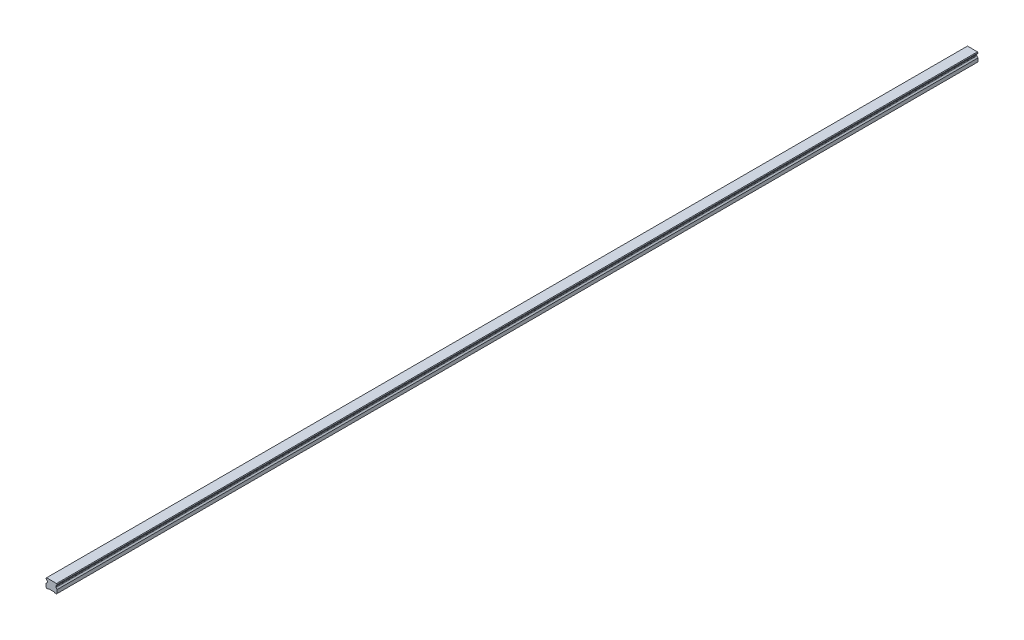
from build123d import *

# Parameters (mm, degrees)
SKETCH1_W           = 20
SKETCH1_H           = 16.3
BOSS_EXTRUDE1_DEPTH = 830
CUT_EXTRUDE1_DEPTH  = 1661.110143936
CHAMFER1_SIZE       = 1
FILLET1_R           = 1
CUT_EXTRUDE2_DEPTH  = 1661.110143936
SKETCH5_R           = 3
SKETCH5_R_2         = 2.5
CUT_EXTRUDE5_DEPTH  = 10
SKETCH5_2_R         = 2.5
CUT_EXTRUDE6_DEPTH  = 13
LPATTERN2_COUNT     = 28
LPATTERN2_PITCH     = 60


with BuildPart() as part:
    # Sketch1 → Boss-Extrude1 (new, symmetric)
    with BuildSketch(Plane.XY):
        with Locations((0, 8.15)):
            Rectangle(SKETCH1_W, SKETCH1_H)
    extrude(amount=BOSS_EXTRUDE1_DEPTH, both=True)

    # Sketch2 → Cut-Extrude1 (cut, through all)
    with BuildSketch(Plane.XY.offset(830)):
        Polygon((-10, 14.3), (-10, 7.3), (-7.666666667, 9.633333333), (-7.666666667, 11.966666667), align=None)
        Polygon((7.666666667, 11.966666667), (10, 14.3), (10, 7.3), (7.666666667, 9.633333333), align=None)
    extrude(amount=-CUT_EXTRUDE1_DEPTH, mode=Mode.SUBTRACT)

    # Chamfer1
    chamfer1_edges = [part.edges().sort_by_distance(p)[0] for p in [
        (-10, 16.3, 0),
        (10, 16.3, 0),
        (10, 0, 0),
        (-10, 0, 0),
    ]]
    chamfer(chamfer1_edges, length=CHAMFER1_SIZE)

    # Fillet1
    fillet1_edges = [part.edges().sort_by_distance(p)[0] for p in [
        (-7.666666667, 11.966666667, 0),
        (-7.666666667, 9.633333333, 0),
        (7.666666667, 9.633333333, 0),
        (7.666666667, 11.966666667, 0),
    ]]
    fillet(fillet1_edges, radius=FILLET1_R)

    # Sketch3 → Cut-Extrude2 (cut, through all)
    with BuildSketch(Plane.XY.offset(830)):
        Polygon((-6, 0), (-5, 1), (5, 1), (6, 0), align=None)
    extrude(amount=-CUT_EXTRUDE2_DEPTH, mode=Mode.SUBTRACT)

    # Sketch5 → Cut-Extrude5 (cut)
    with BuildSketch(Plane.XZ.offset(-1)):
        with Locations(Location((0, 810, 0), (0, 0, 270))):
            Circle(SKETCH5_R)
        with Locations(Location((0, 810, 0), (0, 0, 270))):
            Circle(SKETCH5_R_2, mode=Mode.SUBTRACT)
    cut_extrude5 = extrude(amount=-CUT_EXTRUDE5_DEPTH, mode=Mode.SUBTRACT)

    # Sketch5_2 → Cut-Extrude6 (cut)
    with BuildSketch(Plane.XZ.offset(-1)):
        with Locations(Location((0, 810, 0), (0, 0, 270))):
            Circle(SKETCH5_2_R)
    cut_extrude6 = extrude(amount=-CUT_EXTRUDE6_DEPTH, mode=Mode.SUBTRACT)

    # Cut-Extrude7 cone 1 section (on through the dimple's axis) → Cut-Extrude7 (revolve, cut)
    with BuildSketch(Plane(origin=(0, 14, 810), x_dir=(0, 0, -1), z_dir=(1, 0, 0))):
        Polygon((0, 0), (2.5, 0), (0, 1.443375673), align=None)
    cut_extrude7 = revolve(axis=Axis((0, 14, 810), (0, 1, 0)), mode=Mode.SUBTRACT)

    # LPattern2: Cut-Extrude5, Cut-Extrude6, Cut-Extrude7 ×28
    with Locations(*[(0, 0, -i * LPATTERN2_PITCH) for i in range(1, LPATTERN2_COUNT)]):
        add(cut_extrude5, mode=Mode.SUBTRACT)
        add(cut_extrude6, mode=Mode.SUBTRACT)
        add(cut_extrude7, mode=Mode.SUBTRACT)


solid = part.part
